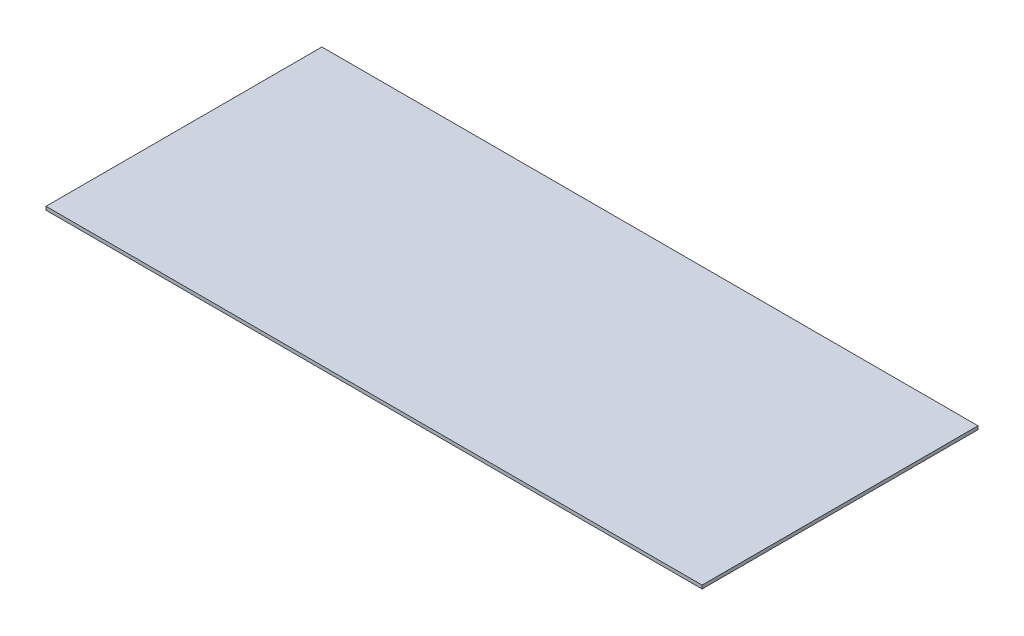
ISO-10303-21;
HEADER;
FILE_DESCRIPTION(('STEP AP214'),'2;1');
FILE_NAME('part.step','',(''),(''),'','','');
FILE_SCHEMA(('AUTOMOTIVE_DESIGN { 1 0 10303 214 1 1 1 1 }'));
ENDSEC;
DATA;
#1=APPLICATION_CONTEXT('core data for automotive mechanical design processes');
#2=APPLICATION_PROTOCOL_DEFINITION('international standard','automotive_design',2000,#1);
#3=PRODUCT_CONTEXT('',#1,'mechanical');
#4=PRODUCT('Part','Part','',(#3));
#5=PRODUCT_RELATED_PRODUCT_CATEGORY('part','',(#4));
#6=PRODUCT_DEFINITION_FORMATION('','',#4);
#7=PRODUCT_DEFINITION_CONTEXT('part definition',#1,'design');
#8=PRODUCT_DEFINITION('design','',#6,#7);
#9=PRODUCT_DEFINITION_SHAPE('','',#8);
#10=(LENGTH_UNIT() NAMED_UNIT(*) SI_UNIT(.MILLI.,.METRE.));
#11=(NAMED_UNIT(*) PLANE_ANGLE_UNIT() SI_UNIT($,.RADIAN.));
#12=(NAMED_UNIT(*) SI_UNIT($,.STERADIAN.) SOLID_ANGLE_UNIT());
#13=UNCERTAINTY_MEASURE_WITH_UNIT(LENGTH_MEASURE(1.E-05),#10,'distance_accuracy_value','');
#14=(GEOMETRIC_REPRESENTATION_CONTEXT(3) GLOBAL_UNCERTAINTY_ASSIGNED_CONTEXT((#13)) GLOBAL_UNIT_ASSIGNED_CONTEXT((#10,
#11,#12)) REPRESENTATION_CONTEXT('',''));
#15=CARTESIAN_POINT('',(0.,0.,0.));
#16=DIRECTION('',(0.,0.,1.));
#17=DIRECTION('',(1.,0.,0.));
#18=AXIS2_PLACEMENT_3D('',#15,#16,#17);
#19=CARTESIAN_POINT('',(0.,12.7,0.));
#20=DIRECTION('',(-1.,0.,0.));
#21=DIRECTION('',(0.,0.,1.));
#22=AXIS2_PLACEMENT_3D('',#19,#20,#21);
#23=PLANE('',#22);
#24=DIRECTION('',(0.,0.,-1.));
#25=VECTOR('',#24,1.);
#26=CARTESIAN_POINT('',(0.,0.,0.));
#27=LINE('',#26,#25);
#28=CARTESIAN_POINT('',(0.,0.,0.));
#29=VERTEX_POINT('',#28);
#30=CARTESIAN_POINT('',(0.,0.,-1025.398));
#31=VERTEX_POINT('',#30);
#32=EDGE_CURVE('E93',#29,#31,#27,.T.);
#33=ORIENTED_EDGE('',*,*,#32,.T.);
#34=DIRECTION('',(0.,-1.,0.));
#35=VECTOR('',#34,1.);
#36=CARTESIAN_POINT('',(0.,12.7,-1025.398));
#37=LINE('',#36,#35);
#38=CARTESIAN_POINT('',(0.,12.7,-1025.398));
#39=VERTEX_POINT('',#38);
#40=EDGE_CURVE('E11',#39,#31,#37,.T.);
#41=ORIENTED_EDGE('',*,*,#40,.F.);
#42=DIRECTION('',(0.,0.,-1.));
#43=VECTOR('',#42,1.);
#44=CARTESIAN_POINT('',(0.,12.7,0.));
#45=LINE('',#44,#43);
#46=CARTESIAN_POINT('',(0.,12.7,0.));
#47=VERTEX_POINT('',#46);
#48=EDGE_CURVE('E81',#47,#39,#45,.T.);
#49=ORIENTED_EDGE('',*,*,#48,.F.);
#50=DIRECTION('',(0.,-1.,0.));
#51=VECTOR('',#50,1.);
#52=CARTESIAN_POINT('',(0.,12.7,0.));
#53=LINE('',#52,#51);
#54=EDGE_CURVE('E89',#47,#29,#53,.T.);
#55=ORIENTED_EDGE('',*,*,#54,.T.);
#56=EDGE_LOOP('',(#33,#41,#49,#55));
#57=FACE_BOUND('',#56,.T.);
#58=ADVANCED_FACE('F30',(#57),#23,.F.);
#59=CARTESIAN_POINT('',(0.,12.7,-1025.398));
#60=DIRECTION('',(0.,0.,1.));
#61=DIRECTION('',(1.,0.,0.));
#62=AXIS2_PLACEMENT_3D('',#59,#60,#61);
#63=PLANE('',#62);
#64=DIRECTION('',(-1.,0.,0.));
#65=VECTOR('',#64,1.);
#66=CARTESIAN_POINT('',(0.,0.,-1025.398));
#67=LINE('',#66,#65);
#68=CARTESIAN_POINT('',(-2438.4,0.,-1025.398));
#69=VERTEX_POINT('',#68);
#70=EDGE_CURVE('E85',#31,#69,#67,.T.);
#71=ORIENTED_EDGE('',*,*,#70,.T.);
#72=DIRECTION('',(0.,-1.,0.));
#73=VECTOR('',#72,1.);
#74=CARTESIAN_POINT('',(-2438.4,12.7,-1025.398));
#75=LINE('',#74,#73);
#76=CARTESIAN_POINT('',(-2438.4,12.7,-1025.398));
#77=VERTEX_POINT('',#76);
#78=EDGE_CURVE('E38',#77,#69,#75,.T.);
#79=ORIENTED_EDGE('',*,*,#78,.F.);
#80=DIRECTION('',(-1.,0.,0.));
#81=VECTOR('',#80,1.);
#82=CARTESIAN_POINT('',(0.,12.7,-1025.398));
#83=LINE('',#82,#81);
#84=EDGE_CURVE('E76',#39,#77,#83,.T.);
#85=ORIENTED_EDGE('',*,*,#84,.F.);
#86=ORIENTED_EDGE('',*,*,#40,.T.);
#87=EDGE_LOOP('',(#71,#79,#85,#86));
#88=FACE_BOUND('',#87,.T.);
#89=ADVANCED_FACE('F84',(#88),#63,.F.);
#90=CARTESIAN_POINT('',(-2438.4,12.7,2.98608013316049E-13));
#91=DIRECTION('',(1.,0.,0.));
#92=DIRECTION('',(0.,0.,-1.));
#93=AXIS2_PLACEMENT_3D('',#90,#91,#92);
#94=PLANE('',#93);
#95=DIRECTION('',(0.,0.,1.));
#96=VECTOR('',#95,1.);
#97=CARTESIAN_POINT('',(-2438.4,0.,2.98608013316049E-13));
#98=LINE('',#97,#96);
#99=CARTESIAN_POINT('',(-2438.4,0.,2.98608013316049E-13));
#100=VERTEX_POINT('',#99);
#101=EDGE_CURVE('E63',#69,#100,#98,.T.);
#102=ORIENTED_EDGE('',*,*,#101,.T.);
#103=DIRECTION('',(0.,-1.,0.));
#104=VECTOR('',#103,1.);
#105=CARTESIAN_POINT('',(-2438.4,12.7,2.98608013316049E-13));
#106=LINE('',#105,#104);
#107=CARTESIAN_POINT('',(-2438.4,12.7,2.98608013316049E-13));
#108=VERTEX_POINT('',#107);
#109=EDGE_CURVE('E86',#108,#100,#106,.T.);
#110=ORIENTED_EDGE('',*,*,#109,.F.);
#111=DIRECTION('',(0.,0.,1.));
#112=VECTOR('',#111,1.);
#113=CARTESIAN_POINT('',(-2438.4,12.7,2.98608013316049E-13));
#114=LINE('',#113,#112);
#115=EDGE_CURVE('E79',#77,#108,#114,.T.);
#116=ORIENTED_EDGE('',*,*,#115,.F.);
#117=ORIENTED_EDGE('',*,*,#78,.T.);
#118=EDGE_LOOP('',(#102,#110,#116,#117));
#119=FACE_BOUND('',#118,.T.);
#120=ADVANCED_FACE('F87',(#119),#94,.F.);
#121=CARTESIAN_POINT('',(0.,12.7,0.));
#122=DIRECTION('',(0.,0.,-1.));
#123=DIRECTION('',(-1.,0.,0.));
#124=AXIS2_PLACEMENT_3D('',#121,#122,#123);
#125=PLANE('',#124);
#126=DIRECTION('',(1.,0.,0.));
#127=VECTOR('',#126,1.);
#128=CARTESIAN_POINT('',(0.,0.,0.));
#129=LINE('',#128,#127);
#130=EDGE_CURVE('E69',#100,#29,#129,.T.);
#131=ORIENTED_EDGE('',*,*,#130,.T.);
#132=ORIENTED_EDGE('',*,*,#54,.F.);
#133=DIRECTION('',(1.,0.,0.));
#134=VECTOR('',#133,1.);
#135=CARTESIAN_POINT('',(0.,12.7,0.));
#136=LINE('',#135,#134);
#137=EDGE_CURVE('E46',#108,#47,#136,.T.);
#138=ORIENTED_EDGE('',*,*,#137,.F.);
#139=ORIENTED_EDGE('',*,*,#109,.T.);
#140=EDGE_LOOP('',(#131,#132,#138,#139));
#141=FACE_BOUND('',#140,.T.);
#142=ADVANCED_FACE('F100',(#141),#125,.F.);
#143=CARTESIAN_POINT('',(0.,12.7,-1025.398));
#144=DIRECTION('',(0.,1.,0.));
#145=DIRECTION('',(0.,0.,1.));
#146=AXIS2_PLACEMENT_3D('',#143,#144,#145);
#147=PLANE('',#146);
#148=ORIENTED_EDGE('',*,*,#48,.T.);
#149=ORIENTED_EDGE('',*,*,#84,.T.);
#150=ORIENTED_EDGE('',*,*,#115,.T.);
#151=ORIENTED_EDGE('',*,*,#137,.T.);
#152=EDGE_LOOP('',(#148,#149,#150,#151));
#153=FACE_BOUND('',#152,.T.);
#154=ADVANCED_FACE('F77',(#153),#147,.T.);
#155=CARTESIAN_POINT('',(0.,0.,-1025.398));
#156=DIRECTION('',(0.,1.,0.));
#157=DIRECTION('',(0.,0.,1.));
#158=AXIS2_PLACEMENT_3D('',#155,#156,#157);
#159=PLANE('',#158);
#160=ORIENTED_EDGE('',*,*,#32,.F.);
#161=ORIENTED_EDGE('',*,*,#130,.F.);
#162=ORIENTED_EDGE('',*,*,#101,.F.);
#163=ORIENTED_EDGE('',*,*,#70,.F.);
#164=EDGE_LOOP('',(#160,#161,#162,#163));
#165=FACE_BOUND('',#164,.T.);
#166=ADVANCED_FACE('F103',(#165),#159,.F.);
#167=CLOSED_SHELL('',(#58,#89,#120,#142,#154,#166));
#168=MANIFOLD_SOLID_BREP('B2',#167);
#169=ADVANCED_BREP_SHAPE_REPRESENTATION('',(#18,#168),#14);
#170=SHAPE_DEFINITION_REPRESENTATION(#9,#169);
ENDSEC;
END-ISO-10303-21;
